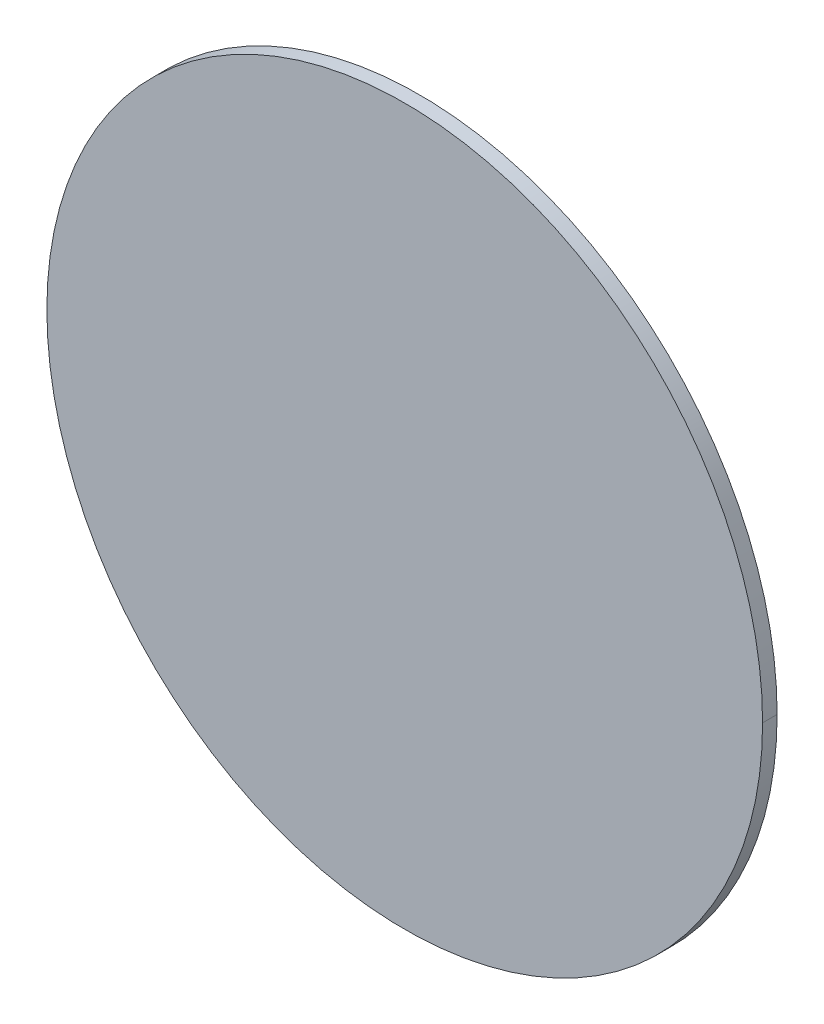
ISO-10303-21;
HEADER;
FILE_DESCRIPTION(('STEP AP214'),'2;1');
FILE_NAME('part.step','',(''),(''),'','','');
FILE_SCHEMA(('AUTOMOTIVE_DESIGN { 1 0 10303 214 1 1 1 1 }'));
ENDSEC;
DATA;
#1=APPLICATION_CONTEXT('core data for automotive mechanical design processes');
#2=APPLICATION_PROTOCOL_DEFINITION('international standard','automotive_design',2000,#1);
#3=PRODUCT_CONTEXT('',#1,'mechanical');
#4=PRODUCT('Part','Part','',(#3));
#5=PRODUCT_RELATED_PRODUCT_CATEGORY('part','',(#4));
#6=PRODUCT_DEFINITION_FORMATION('','',#4);
#7=PRODUCT_DEFINITION_CONTEXT('part definition',#1,'design');
#8=PRODUCT_DEFINITION('design','',#6,#7);
#9=PRODUCT_DEFINITION_SHAPE('','',#8);
#10=(LENGTH_UNIT() NAMED_UNIT(*) SI_UNIT(.MILLI.,.METRE.));
#11=(NAMED_UNIT(*) PLANE_ANGLE_UNIT() SI_UNIT($,.RADIAN.));
#12=(NAMED_UNIT(*) SI_UNIT($,.STERADIAN.) SOLID_ANGLE_UNIT());
#13=UNCERTAINTY_MEASURE_WITH_UNIT(LENGTH_MEASURE(1.E-05),#10,'distance_accuracy_value','');
#14=(GEOMETRIC_REPRESENTATION_CONTEXT(3) GLOBAL_UNCERTAINTY_ASSIGNED_CONTEXT((#13)) GLOBAL_UNIT_ASSIGNED_CONTEXT((#10,
#11,#12)) REPRESENTATION_CONTEXT('',''));
#15=CARTESIAN_POINT('',(0.,0.,0.));
#16=DIRECTION('',(0.,0.,1.));
#17=DIRECTION('',(1.,0.,0.));
#18=AXIS2_PLACEMENT_3D('',#15,#16,#17);
#19=CARTESIAN_POINT('',(20.5000007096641,22.6999992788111,-0.73152));
#20=DIRECTION('',(0.,0.,1.));
#21=DIRECTION('',(0.999999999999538,9.61586126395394E-07,0.));
#22=AXIS2_PLACEMENT_3D('',#19,#20,#21);
#23=CYLINDRICAL_SURFACE('',#22,0.749999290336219);
#24=DIRECTION('',(0.,0.,1.));
#25=VECTOR('',#24,1.);
#26=CARTESIAN_POINT('',(21.25,22.7,-0.73152));
#27=LINE('',#26,#25);
#28=CARTESIAN_POINT('',(21.25,22.7,-0.73152));
#29=VERTEX_POINT('',#28);
#30=CARTESIAN_POINT('',(21.25,22.7,-0.70104));
#31=VERTEX_POINT('',#30);
#32=EDGE_CURVE('E51',#29,#31,#27,.T.);
#33=ORIENTED_EDGE('',*,*,#32,.T.);
#34=CARTESIAN_POINT('',(20.5000007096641,22.6999992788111,-0.70104));
#35=DIRECTION('',(0.,0.,1.));
#36=DIRECTION('',(0.999999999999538,9.61586126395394E-07,0.));
#37=AXIS2_PLACEMENT_3D('',#34,#35,#36);
#38=CIRCLE('',#37,0.749999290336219);
#39=CARTESIAN_POINT('',(19.7500014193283,22.6999985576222,-0.70104));
#40=VERTEX_POINT('',#39);
#41=EDGE_CURVE('E25',#40,#31,#38,.T.);
#42=ORIENTED_EDGE('',*,*,#41,.F.);
#43=DIRECTION('',(0.,0.,-1.));
#44=VECTOR('',#43,1.);
#45=CARTESIAN_POINT('',(19.7500014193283,22.6999985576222,-0.73152));
#46=LINE('',#45,#44);
#47=CARTESIAN_POINT('',(19.7500014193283,22.6999985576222,-0.73152));
#48=VERTEX_POINT('',#47);
#49=EDGE_CURVE('E53',#40,#48,#46,.T.);
#50=ORIENTED_EDGE('',*,*,#49,.T.);
#51=CARTESIAN_POINT('',(20.5000007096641,22.6999992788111,-0.73152));
#52=DIRECTION('',(0.,0.,1.));
#53=DIRECTION('',(0.999999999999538,9.61586126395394E-07,0.));
#54=AXIS2_PLACEMENT_3D('',#51,#52,#53);
#55=CIRCLE('',#54,0.749999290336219);
#56=EDGE_CURVE('E11',#48,#29,#55,.T.);
#57=ORIENTED_EDGE('',*,*,#56,.T.);
#58=EDGE_LOOP('',(#33,#42,#50,#57));
#59=FACE_BOUND('',#58,.T.);
#60=ADVANCED_FACE('F17',(#59),#23,.T.);
#61=CARTESIAN_POINT('',(20.5000007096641,22.6999992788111,-0.73152));
#62=DIRECTION('',(0.,0.,1.));
#63=DIRECTION('',(1.,0.,0.));
#64=AXIS2_PLACEMENT_3D('',#61,#62,#63);
#65=PLANE('',#64);
#66=CARTESIAN_POINT('',(20.5000007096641,22.6999992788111,-0.73152));
#67=DIRECTION('',(0.,0.,1.));
#68=DIRECTION('',(0.999999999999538,9.61586126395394E-07,0.));
#69=AXIS2_PLACEMENT_3D('',#66,#67,#68);
#70=CIRCLE('',#69,0.749999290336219);
#71=EDGE_CURVE('E55',#29,#48,#70,.T.);
#72=ORIENTED_EDGE('',*,*,#71,.F.);
#73=ORIENTED_EDGE('',*,*,#56,.F.);
#74=EDGE_LOOP('',(#72,#73));
#75=FACE_BOUND('',#74,.T.);
#76=ADVANCED_FACE('F56',(#75),#65,.F.);
#77=CARTESIAN_POINT('',(20.5000007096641,22.6999992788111,-0.70104));
#78=DIRECTION('',(0.,0.,1.));
#79=DIRECTION('',(1.,0.,0.));
#80=AXIS2_PLACEMENT_3D('',#77,#78,#79);
#81=PLANE('',#80);
#82=CARTESIAN_POINT('',(20.5000007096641,22.6999992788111,-0.70104));
#83=DIRECTION('',(0.,0.,1.));
#84=DIRECTION('',(0.999999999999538,9.61586126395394E-07,0.));
#85=AXIS2_PLACEMENT_3D('',#82,#83,#84);
#86=CIRCLE('',#85,0.749999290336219);
#87=EDGE_CURVE('E62',#31,#40,#86,.T.);
#88=ORIENTED_EDGE('',*,*,#87,.T.);
#89=ORIENTED_EDGE('',*,*,#41,.T.);
#90=EDGE_LOOP('',(#88,#89));
#91=FACE_BOUND('',#90,.T.);
#92=ADVANCED_FACE('F73',(#91),#81,.T.);
#93=CARTESIAN_POINT('',(20.5000007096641,22.6999992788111,-0.73152));
#94=DIRECTION('',(0.,0.,1.));
#95=DIRECTION('',(0.999999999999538,9.61586126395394E-07,0.));
#96=AXIS2_PLACEMENT_3D('',#93,#94,#95);
#97=CYLINDRICAL_SURFACE('',#96,0.749999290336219);
#98=ORIENTED_EDGE('',*,*,#32,.F.);
#99=ORIENTED_EDGE('',*,*,#71,.T.);
#100=ORIENTED_EDGE('',*,*,#49,.F.);
#101=ORIENTED_EDGE('',*,*,#87,.F.);
#102=EDGE_LOOP('',(#98,#99,#100,#101));
#103=FACE_BOUND('',#102,.T.);
#104=ADVANCED_FACE('F61',(#103),#97,.T.);
#105=CLOSED_SHELL('',(#60,#76,#92,#104));
#106=MANIFOLD_SOLID_BREP('B1',#105);
#107=ADVANCED_BREP_SHAPE_REPRESENTATION('',(#18,#106),#14);
#108=SHAPE_DEFINITION_REPRESENTATION(#9,#107);
ENDSEC;
END-ISO-10303-21;
